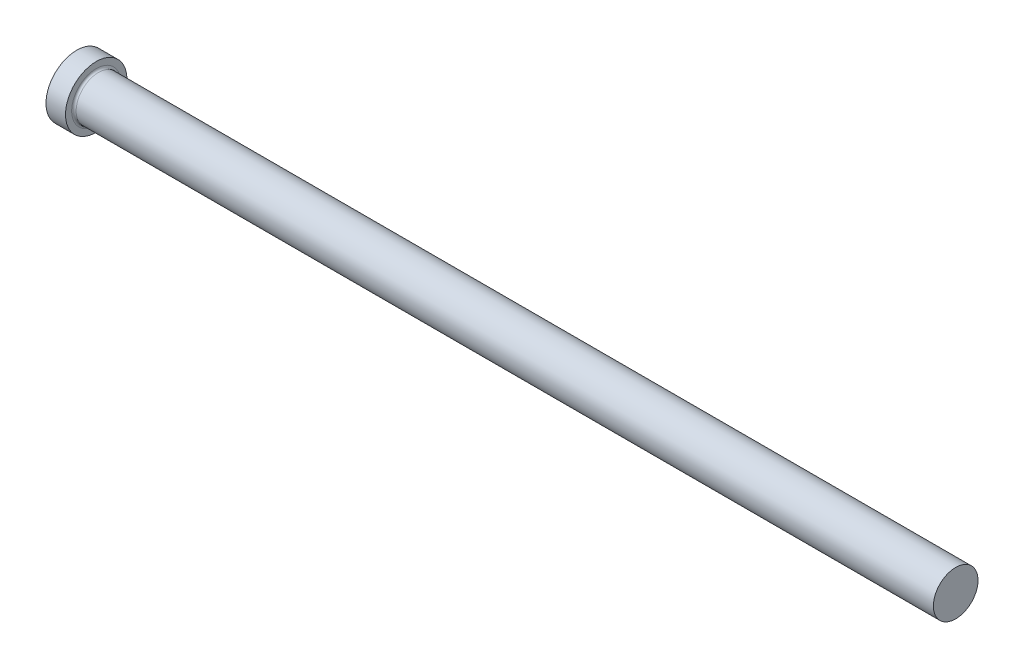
ISO-10303-21;
HEADER;
FILE_DESCRIPTION(('STEP AP214'),'2;1');
FILE_NAME('part.step','',(''),(''),'','','');
FILE_SCHEMA(('AUTOMOTIVE_DESIGN { 1 0 10303 214 1 1 1 1 }'));
ENDSEC;
DATA;
#1=APPLICATION_CONTEXT('core data for automotive mechanical design processes');
#2=APPLICATION_PROTOCOL_DEFINITION('international standard','automotive_design',2000,#1);
#3=PRODUCT_CONTEXT('',#1,'mechanical');
#4=PRODUCT('Part','Part','',(#3));
#5=PRODUCT_RELATED_PRODUCT_CATEGORY('part','',(#4));
#6=PRODUCT_DEFINITION_FORMATION('','',#4);
#7=PRODUCT_DEFINITION_CONTEXT('part definition',#1,'design');
#8=PRODUCT_DEFINITION('design','',#6,#7);
#9=PRODUCT_DEFINITION_SHAPE('','',#8);
#10=(LENGTH_UNIT() NAMED_UNIT(*) SI_UNIT(.MILLI.,.METRE.));
#11=(NAMED_UNIT(*) PLANE_ANGLE_UNIT() SI_UNIT($,.RADIAN.));
#12=(NAMED_UNIT(*) SI_UNIT($,.STERADIAN.) SOLID_ANGLE_UNIT());
#13=UNCERTAINTY_MEASURE_WITH_UNIT(LENGTH_MEASURE(1.E-05),#10,'distance_accuracy_value','');
#14=(GEOMETRIC_REPRESENTATION_CONTEXT(3) GLOBAL_UNCERTAINTY_ASSIGNED_CONTEXT((#13)) GLOBAL_UNIT_ASSIGNED_CONTEXT((#10,
#11,#12)) REPRESENTATION_CONTEXT('',''));
#15=CARTESIAN_POINT('',(0.,0.,0.));
#16=DIRECTION('',(0.,0.,1.));
#17=DIRECTION('',(1.,0.,0.));
#18=AXIS2_PLACEMENT_3D('',#15,#16,#17);
#19=CARTESIAN_POINT('',(0.,0.,0.));
#20=DIRECTION('',(-1.,0.,0.));
#21=DIRECTION('',(0.,-1.,0.));
#22=AXIS2_PLACEMENT_3D('',#19,#20,#21);
#23=PLANE('',#22);
#24=CARTESIAN_POINT('',(0.,0.,0.));
#25=DIRECTION('',(1.,0.,0.));
#26=DIRECTION('',(0.,1.,0.));
#27=AXIS2_PLACEMENT_3D('',#24,#25,#26);
#28=CIRCLE('',#27,11.);
#29=CARTESIAN_POINT('',(0.,11.,0.));
#30=VERTEX_POINT('',#29);
#31=EDGE_CURVE('E25',#30,#30,#28,.T.);
#32=ORIENTED_EDGE('',*,*,#31,.F.);
#33=EDGE_LOOP('',(#32));
#34=FACE_BOUND('',#33,.T.);
#35=ADVANCED_FACE('F14',(#34),#23,.T.);
#36=CARTESIAN_POINT('',(315.,0.,0.));
#37=DIRECTION('',(1.,0.,0.));
#38=DIRECTION('',(0.,1.,0.));
#39=AXIS2_PLACEMENT_3D('',#36,#37,#38);
#40=CYLINDRICAL_SURFACE('',#39,11.);
#41=ORIENTED_EDGE('',*,*,#31,.T.);
#42=EDGE_LOOP('',(#41));
#43=FACE_BOUND('',#42,.T.);
#44=CARTESIAN_POINT('',(7.,0.,0.));
#45=DIRECTION('',(1.,0.,0.));
#46=DIRECTION('',(0.,1.,0.));
#47=AXIS2_PLACEMENT_3D('',#44,#45,#46);
#48=CIRCLE('',#47,11.);
#49=CARTESIAN_POINT('',(7.,11.,0.));
#50=VERTEX_POINT('',#49);
#51=EDGE_CURVE('E29',#50,#50,#48,.T.);
#52=ORIENTED_EDGE('',*,*,#51,.F.);
#53=EDGE_LOOP('',(#52));
#54=FACE_BOUND('',#53,.T.);
#55=ADVANCED_FACE('F51',(#43,#54),#40,.T.);
#56=CARTESIAN_POINT('',(7.,11.,0.));
#57=DIRECTION('',(1.,0.,0.));
#58=DIRECTION('',(0.,1.,0.));
#59=AXIS2_PLACEMENT_3D('',#56,#57,#58);
#60=PLANE('',#59);
#61=CARTESIAN_POINT('',(7.,0.,0.));
#62=DIRECTION('',(1.,0.,0.));
#63=DIRECTION('',(0.,1.,0.));
#64=AXIS2_PLACEMENT_3D('',#61,#62,#63);
#65=CIRCLE('',#64,8.8);
#66=CARTESIAN_POINT('',(7.,8.8,0.));
#67=VERTEX_POINT('',#66);
#68=EDGE_CURVE('E9',#67,#67,#65,.F.);
#69=ORIENTED_EDGE('',*,*,#68,.T.);
#70=EDGE_LOOP('',(#69));
#71=FACE_BOUND('',#70,.T.);
#72=ORIENTED_EDGE('',*,*,#51,.T.);
#73=EDGE_LOOP('',(#72));
#74=FACE_BOUND('',#73,.T.);
#75=ADVANCED_FACE('F42',(#71,#74),#60,.T.);
#76=CARTESIAN_POINT('',(315.,0.,0.));
#77=DIRECTION('',(1.,0.,0.));
#78=DIRECTION('',(0.,1.,0.));
#79=AXIS2_PLACEMENT_3D('',#76,#77,#78);
#80=CYLINDRICAL_SURFACE('',#79,8.);
#81=CARTESIAN_POINT('',(7.8,0.,0.));
#82=DIRECTION('',(1.,0.,0.));
#83=DIRECTION('',(0.,1.,0.));
#84=AXIS2_PLACEMENT_3D('',#81,#82,#83);
#85=CIRCLE('',#84,8.);
#86=CARTESIAN_POINT('',(7.8,8.,0.));
#87=VERTEX_POINT('',#86);
#88=EDGE_CURVE('E21',#87,#87,#85,.T.);
#89=ORIENTED_EDGE('',*,*,#88,.T.);
#90=EDGE_LOOP('',(#89));
#91=FACE_BOUND('',#90,.T.);
#92=CARTESIAN_POINT('',(315.,0.,0.));
#93=DIRECTION('',(1.,0.,0.));
#94=DIRECTION('',(0.,1.,0.));
#95=AXIS2_PLACEMENT_3D('',#92,#93,#94);
#96=CIRCLE('',#95,8.);
#97=CARTESIAN_POINT('',(315.,8.00000000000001,0.));
#98=VERTEX_POINT('',#97);
#99=EDGE_CURVE('E34',#98,#98,#96,.T.);
#100=ORIENTED_EDGE('',*,*,#99,.F.);
#101=EDGE_LOOP('',(#100));
#102=FACE_BOUND('',#101,.T.);
#103=ADVANCED_FACE('F40',(#91,#102),#80,.T.);
#104=CARTESIAN_POINT('',(315.,8.,0.));
#105=DIRECTION('',(1.,0.,0.));
#106=DIRECTION('',(0.,1.,0.));
#107=AXIS2_PLACEMENT_3D('',#104,#105,#106);
#108=PLANE('',#107);
#109=ORIENTED_EDGE('',*,*,#99,.T.);
#110=EDGE_LOOP('',(#109));
#111=FACE_BOUND('',#110,.T.);
#112=ADVANCED_FACE('F38',(#111),#108,.T.);
#113=CARTESIAN_POINT('',(7.8,0.,0.));
#114=DIRECTION('',(1.,0.,0.));
#115=DIRECTION('',(0.,1.,0.));
#116=AXIS2_PLACEMENT_3D('',#113,#114,#115);
#117=TOROIDAL_SURFACE('',#116,8.8,0.8);
#118=ORIENTED_EDGE('',*,*,#68,.F.);
#119=EDGE_LOOP('',(#118));
#120=FACE_BOUND('',#119,.T.);
#121=ORIENTED_EDGE('',*,*,#88,.F.);
#122=EDGE_LOOP('',(#121));
#123=FACE_BOUND('',#122,.T.);
#124=ADVANCED_FACE('F16',(#120,#123),#117,.F.);
#125=CLOSED_SHELL('',(#35,#55,#75,#103,#112,#124));
#126=MANIFOLD_SOLID_BREP('B1',#125);
#127=ADVANCED_BREP_SHAPE_REPRESENTATION('',(#18,#126),#14);
#128=SHAPE_DEFINITION_REPRESENTATION(#9,#127);
ENDSEC;
END-ISO-10303-21;
